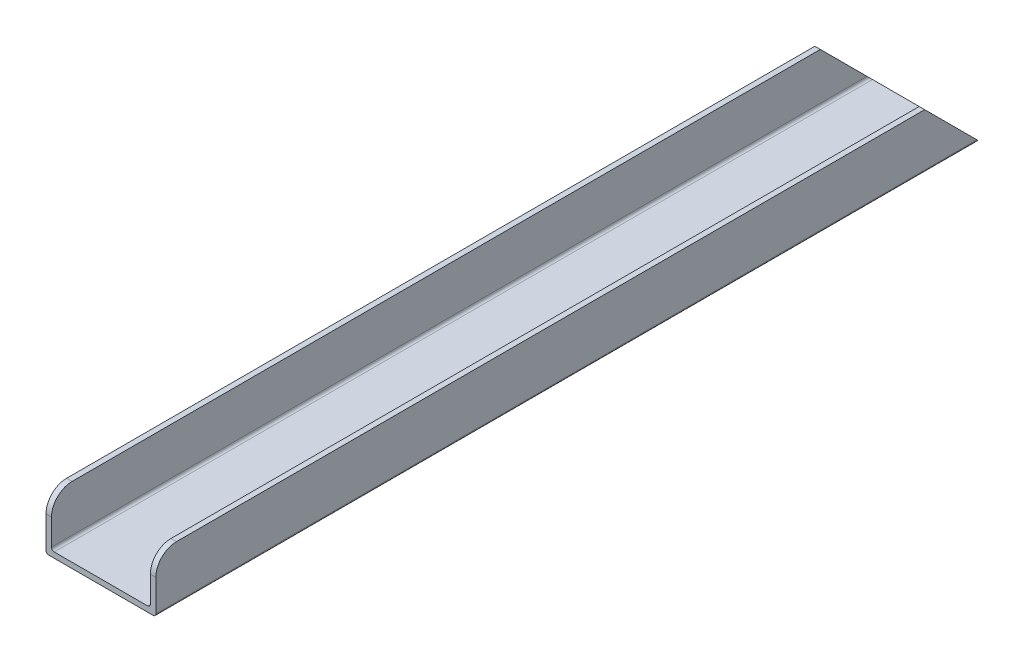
from build123d import *

# Parameters (mm, degrees)
BOSS_EXTRU_1_DEPTH           = 600
ENL_V_MAT_EXTRU_1_DEPTH      = 607.630035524
ENL_V_MAT_EXTRU_1_DEPTH_BACK = 607.630035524
CONG_1_R                     = 15


with BuildPart() as part:
    # Esquisse1 → Boss.-Extru.1 (new body)
    with BuildSketch(Plane.XY):
        with BuildLine():
            Line((-38, 0), (38, 0))
            ThreePointArc((38, 0), (39.414213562, 0.585786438), (40, 2))
            Line((40, 2), (40, 40))
            Line((40, 40), (36, 40))
            Line((36, 40), (36, 6))
            ThreePointArc((36, 6), (35.414213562, 4.585786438), (34, 4))
            Line((34, 4), (-34, 4))
            ThreePointArc((-34, 4), (-35.414213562, 4.585786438), (-36, 6))
            Line((-36, 6), (-36, 40))
            Line((-36, 40), (-40, 40))
            Line((-40, 40), (-40, 2))
            ThreePointArc((-40, 2), (-39.414213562, 0.585786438), (-38, 0))
        make_face()
    extrude(amount=BOSS_EXTRU_1_DEPTH)

    # Esquisse2 → Enl_v. mat.-Extru.1 (cut, two sides: drawn at the far end of the back side and taken through both)
    with BuildSketch(Plane.ZY.offset(40).offset(-ENL_V_MAT_EXTRU_1_DEPTH_BACK)):
        Polygon((-857.482732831, -857.482732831), (0, 0), (40, 40), (897.482732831, 897.482732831), (-817.482732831, 2612.448198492), (-2572.448198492, 857.482732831), align=None)
    extrude(amount=ENL_V_MAT_EXTRU_1_DEPTH + ENL_V_MAT_EXTRU_1_DEPTH_BACK, mode=Mode.SUBTRACT)

    # Cong_1
    cong_1_edges = [part.edges().sort_by_distance(p)[0] for p in [
        (-38, 40, 600),
        (38, 40, 600),
    ]]
    fillet(cong_1_edges, radius=CONG_1_R)


solid = part.part
